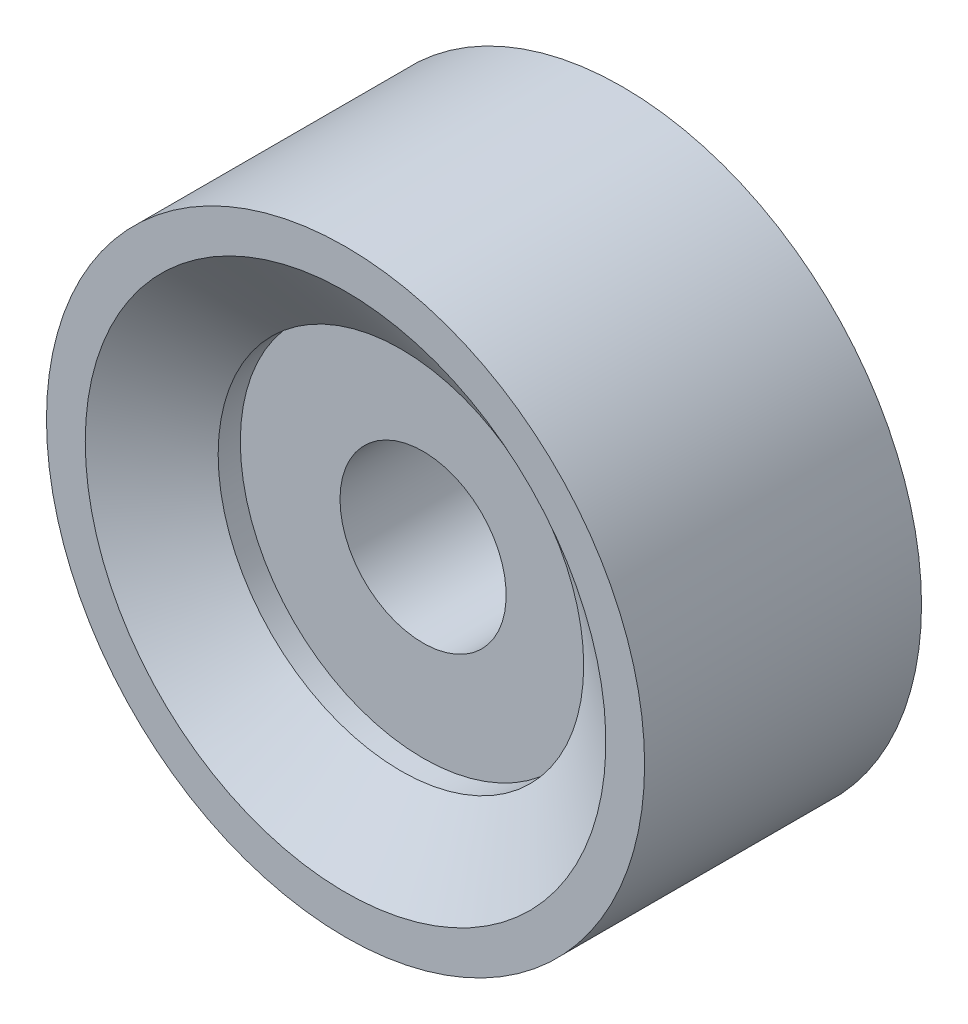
ISO-10303-21;
HEADER;
FILE_DESCRIPTION(('STEP AP214'),'2;1');
FILE_NAME('part.step','',(''),(''),'','','');
FILE_SCHEMA(('AUTOMOTIVE_DESIGN { 1 0 10303 214 1 1 1 1 }'));
ENDSEC;
DATA;
#1=APPLICATION_CONTEXT('core data for automotive mechanical design processes');
#2=APPLICATION_PROTOCOL_DEFINITION('international standard','automotive_design',2000,#1);
#3=PRODUCT_CONTEXT('',#1,'mechanical');
#4=PRODUCT('Part','Part','',(#3));
#5=PRODUCT_RELATED_PRODUCT_CATEGORY('part','',(#4));
#6=PRODUCT_DEFINITION_FORMATION('','',#4);
#7=PRODUCT_DEFINITION_CONTEXT('part definition',#1,'design');
#8=PRODUCT_DEFINITION('design','',#6,#7);
#9=PRODUCT_DEFINITION_SHAPE('','',#8);
#10=(LENGTH_UNIT() NAMED_UNIT(*) SI_UNIT(.MILLI.,.METRE.));
#11=(NAMED_UNIT(*) PLANE_ANGLE_UNIT() SI_UNIT($,.RADIAN.));
#12=(NAMED_UNIT(*) SI_UNIT($,.STERADIAN.) SOLID_ANGLE_UNIT());
#13=UNCERTAINTY_MEASURE_WITH_UNIT(LENGTH_MEASURE(1.E-05),#10,'distance_accuracy_value','');
#14=(GEOMETRIC_REPRESENTATION_CONTEXT(3) GLOBAL_UNCERTAINTY_ASSIGNED_CONTEXT((#13)) GLOBAL_UNIT_ASSIGNED_CONTEXT((#10,
#11,#12)) REPRESENTATION_CONTEXT('',''));
#15=CARTESIAN_POINT('',(0.,0.,0.));
#16=DIRECTION('',(0.,0.,1.));
#17=DIRECTION('',(1.,0.,0.));
#18=AXIS2_PLACEMENT_3D('',#15,#16,#17);
#19=CARTESIAN_POINT('',(0.,32.5,12.5));
#20=DIRECTION('',(0.,0.,1.));
#21=DIRECTION('',(1.,0.,0.));
#22=AXIS2_PLACEMENT_3D('',#19,#20,#21);
#23=PLANE('',#22);
#24=CARTESIAN_POINT('',(0.,0.,12.5));
#25=DIRECTION('',(0.,0.,-1.));
#26=DIRECTION('',(-1.,0.,0.));
#27=AXIS2_PLACEMENT_3D('',#24,#25,#26);
#28=CIRCLE('',#27,23.5);
#29=CARTESIAN_POINT('',(-23.5,0.,12.5));
#30=VERTEX_POINT('',#29);
#31=EDGE_CURVE('E32',#30,#30,#28,.T.);
#32=ORIENTED_EDGE('',*,*,#31,.T.);
#33=EDGE_LOOP('',(#32));
#34=FACE_BOUND('',#33,.T.);
#35=CARTESIAN_POINT('',(0.,0.,12.5));
#36=DIRECTION('',(0.,0.,1.));
#37=DIRECTION('',(1.,0.,0.));
#38=AXIS2_PLACEMENT_3D('',#35,#36,#37);
#39=CIRCLE('',#38,27.);
#40=CARTESIAN_POINT('',(27.,0.,12.5));
#41=VERTEX_POINT('',#40);
#42=EDGE_CURVE('E45',#41,#41,#39,.T.);
#43=ORIENTED_EDGE('',*,*,#42,.T.);
#44=EDGE_LOOP('',(#43));
#45=FACE_BOUND('',#44,.T.);
#46=ADVANCED_FACE('F12',(#34,#45),#23,.T.);
#47=CARTESIAN_POINT('',(0.,32.5,-12.5));
#48=DIRECTION('',(0.,0.,1.));
#49=DIRECTION('',(1.,0.,0.));
#50=AXIS2_PLACEMENT_3D('',#47,#48,#49);
#51=PLANE('',#50);
#52=CARTESIAN_POINT('',(0.,0.,-12.5));
#53=DIRECTION('',(0.,0.,-1.));
#54=DIRECTION('',(-1.,0.,0.));
#55=AXIS2_PLACEMENT_3D('',#52,#53,#54);
#56=CIRCLE('',#55,23.5);
#57=CARTESIAN_POINT('',(-23.5,0.,-12.5));
#58=VERTEX_POINT('',#57);
#59=EDGE_CURVE('E35',#58,#58,#56,.T.);
#60=ORIENTED_EDGE('',*,*,#59,.F.);
#61=EDGE_LOOP('',(#60));
#62=FACE_BOUND('',#61,.T.);
#63=CARTESIAN_POINT('',(0.,0.,-12.5));
#64=DIRECTION('',(0.,0.,1.));
#65=DIRECTION('',(1.,0.,0.));
#66=AXIS2_PLACEMENT_3D('',#63,#64,#65);
#67=CIRCLE('',#66,27.);
#68=CARTESIAN_POINT('',(27.,0.,-12.5));
#69=VERTEX_POINT('',#68);
#70=EDGE_CURVE('E44',#69,#69,#67,.T.);
#71=ORIENTED_EDGE('',*,*,#70,.F.);
#72=EDGE_LOOP('',(#71));
#73=FACE_BOUND('',#72,.T.);
#74=ADVANCED_FACE('F54',(#62,#73),#51,.F.);
#75=CARTESIAN_POINT('',(0.,7.5,-5.5));
#76=DIRECTION('',(0.,0.,-1.));
#77=DIRECTION('',(-1.,0.,0.));
#78=AXIS2_PLACEMENT_3D('',#75,#76,#77);
#79=PLANE('',#78);
#80=CARTESIAN_POINT('',(0.,0.,-5.5));
#81=DIRECTION('',(0.,0.,-1.));
#82=DIRECTION('',(-1.,0.,0.));
#83=AXIS2_PLACEMENT_3D('',#80,#81,#82);
#84=CIRCLE('',#83,16.5);
#85=CARTESIAN_POINT('',(-16.5,0.,-5.5));
#86=VERTEX_POINT('',#85);
#87=EDGE_CURVE('E41',#86,#86,#84,.T.);
#88=ORIENTED_EDGE('',*,*,#87,.T.);
#89=EDGE_LOOP('',(#88));
#90=FACE_BOUND('',#89,.T.);
#91=CARTESIAN_POINT('',(0.,0.,-5.5));
#92=DIRECTION('',(0.,0.,-1.));
#93=DIRECTION('',(-1.,0.,0.));
#94=AXIS2_PLACEMENT_3D('',#91,#92,#93);
#95=CIRCLE('',#94,7.5);
#96=CARTESIAN_POINT('',(-7.5,0.,-5.5));
#97=VERTEX_POINT('',#96);
#98=EDGE_CURVE('E8',#97,#97,#95,.T.);
#99=ORIENTED_EDGE('',*,*,#98,.F.);
#100=EDGE_LOOP('',(#99));
#101=FACE_BOUND('',#100,.T.);
#102=ADVANCED_FACE('F14',(#90,#101),#79,.T.);
#103=CARTESIAN_POINT('',(0.,0.,-20.));
#104=DIRECTION('',(0.,0.,-1.));
#105=DIRECTION('',(-1.,0.,0.));
#106=AXIS2_PLACEMENT_3D('',#103,#104,#105);
#107=CYLINDRICAL_SURFACE('',#106,7.5);
#108=ORIENTED_EDGE('',*,*,#98,.T.);
#109=EDGE_LOOP('',(#108));
#110=FACE_BOUND('',#109,.T.);
#111=CARTESIAN_POINT('',(0.,0.,5.5));
#112=DIRECTION('',(0.,0.,-1.));
#113=DIRECTION('',(-1.,0.,0.));
#114=AXIS2_PLACEMENT_3D('',#111,#112,#113);
#115=CIRCLE('',#114,7.5);
#116=CARTESIAN_POINT('',(-7.5,0.,5.5));
#117=VERTEX_POINT('',#116);
#118=EDGE_CURVE('E19',#117,#117,#115,.T.);
#119=ORIENTED_EDGE('',*,*,#118,.F.);
#120=EDGE_LOOP('',(#119));
#121=FACE_BOUND('',#120,.T.);
#122=ADVANCED_FACE('F64',(#110,#121),#107,.F.);
#123=CARTESIAN_POINT('',(0.,7.5,5.5));
#124=DIRECTION('',(0.,0.,-1.));
#125=DIRECTION('',(-1.,0.,0.));
#126=AXIS2_PLACEMENT_3D('',#123,#124,#125);
#127=PLANE('',#126);
#128=CARTESIAN_POINT('',(0.,0.,5.5));
#129=DIRECTION('',(0.,0.,-1.));
#130=DIRECTION('',(-1.,0.,0.));
#131=AXIS2_PLACEMENT_3D('',#128,#129,#130);
#132=CIRCLE('',#131,16.5);
#133=CARTESIAN_POINT('',(-16.5,0.,5.5));
#134=VERTEX_POINT('',#133);
#135=EDGE_CURVE('E23',#134,#134,#132,.T.);
#136=ORIENTED_EDGE('',*,*,#135,.F.);
#137=EDGE_LOOP('',(#136));
#138=FACE_BOUND('',#137,.T.);
#139=ORIENTED_EDGE('',*,*,#118,.T.);
#140=EDGE_LOOP('',(#139));
#141=FACE_BOUND('',#140,.T.);
#142=ADVANCED_FACE('F80',(#138,#141),#127,.F.);
#143=CARTESIAN_POINT('',(0.,0.,-20.));
#144=DIRECTION('',(0.,0.,-1.));
#145=DIRECTION('',(-1.,0.,0.));
#146=AXIS2_PLACEMENT_3D('',#143,#144,#145);
#147=CYLINDRICAL_SURFACE('',#146,16.5);
#148=CARTESIAN_POINT('',(0.,0.,7.5));
#149=DIRECTION('',(0.,0.,-1.));
#150=DIRECTION('',(-1.,0.,0.));
#151=AXIS2_PLACEMENT_3D('',#148,#149,#150);
#152=CIRCLE('',#151,16.5);
#153=CARTESIAN_POINT('',(-16.5,0.,7.5));
#154=VERTEX_POINT('',#153);
#155=EDGE_CURVE('E27',#154,#154,#152,.T.);
#156=ORIENTED_EDGE('',*,*,#155,.F.);
#157=EDGE_LOOP('',(#156));
#158=FACE_BOUND('',#157,.T.);
#159=ORIENTED_EDGE('',*,*,#135,.T.);
#160=EDGE_LOOP('',(#159));
#161=FACE_BOUND('',#160,.T.);
#162=ADVANCED_FACE('F76',(#158,#161),#147,.F.);
#163=CARTESIAN_POINT('',(0.,0.,7.5));
#164=DIRECTION('',(0.,0.,1.));
#165=DIRECTION('',(1.,0.,0.));
#166=AXIS2_PLACEMENT_3D('',#163,#164,#165);
#167=CONICAL_SURFACE('',#166,16.5,0.950546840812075);
#168=ORIENTED_EDGE('',*,*,#31,.F.);
#169=EDGE_LOOP('',(#168));
#170=FACE_BOUND('',#169,.T.);
#171=ORIENTED_EDGE('',*,*,#155,.T.);
#172=EDGE_LOOP('',(#171));
#173=FACE_BOUND('',#172,.T.);
#174=ADVANCED_FACE('F73',(#170,#173),#167,.F.);
#175=CARTESIAN_POINT('',(0.,0.,-7.5));
#176=DIRECTION('',(0.,0.,-1.));
#177=DIRECTION('',(-1.,0.,0.));
#178=AXIS2_PLACEMENT_3D('',#175,#176,#177);
#179=CONICAL_SURFACE('',#178,16.5,0.950546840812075);
#180=ORIENTED_EDGE('',*,*,#59,.T.);
#181=EDGE_LOOP('',(#180));
#182=FACE_BOUND('',#181,.T.);
#183=CARTESIAN_POINT('',(0.,0.,-7.5));
#184=DIRECTION('',(0.,0.,-1.));
#185=DIRECTION('',(-1.,0.,0.));
#186=AXIS2_PLACEMENT_3D('',#183,#184,#185);
#187=CIRCLE('',#186,16.5);
#188=CARTESIAN_POINT('',(-16.5,0.,-7.5));
#189=VERTEX_POINT('',#188);
#190=EDGE_CURVE('E38',#189,#189,#187,.T.);
#191=ORIENTED_EDGE('',*,*,#190,.F.);
#192=EDGE_LOOP('',(#191));
#193=FACE_BOUND('',#192,.T.);
#194=ADVANCED_FACE('F70',(#182,#193),#179,.F.);
#195=CARTESIAN_POINT('',(0.,0.,-20.));
#196=DIRECTION('',(0.,0.,-1.));
#197=DIRECTION('',(-1.,0.,0.));
#198=AXIS2_PLACEMENT_3D('',#195,#196,#197);
#199=CYLINDRICAL_SURFACE('',#198,16.5);
#200=ORIENTED_EDGE('',*,*,#190,.T.);
#201=EDGE_LOOP('',(#200));
#202=FACE_BOUND('',#201,.T.);
#203=ORIENTED_EDGE('',*,*,#87,.F.);
#204=EDGE_LOOP('',(#203));
#205=FACE_BOUND('',#204,.T.);
#206=ADVANCED_FACE('F118',(#202,#205),#199,.F.);
#207=CARTESIAN_POINT('',(0.,0.,-12.5));
#208=DIRECTION('',(0.,0.,1.));
#209=DIRECTION('',(1.,0.,0.));
#210=AXIS2_PLACEMENT_3D('',#207,#208,#209);
#211=CYLINDRICAL_SURFACE('',#210,27.);
#212=ORIENTED_EDGE('',*,*,#70,.T.);
#213=EDGE_LOOP('',(#212));
#214=FACE_BOUND('',#213,.T.);
#215=ORIENTED_EDGE('',*,*,#42,.F.);
#216=EDGE_LOOP('',(#215));
#217=FACE_BOUND('',#216,.T.);
#218=ADVANCED_FACE('F51',(#214,#217),#211,.T.);
#219=CLOSED_SHELL('',(#46,#74,#102,#122,#142,#162,#174,#194,#206,#218));
#220=MANIFOLD_SOLID_BREP('B1',#219);
#221=ADVANCED_BREP_SHAPE_REPRESENTATION('',(#18,#220),#14);
#222=SHAPE_DEFINITION_REPRESENTATION(#9,#221);
ENDSEC;
END-ISO-10303-21;
